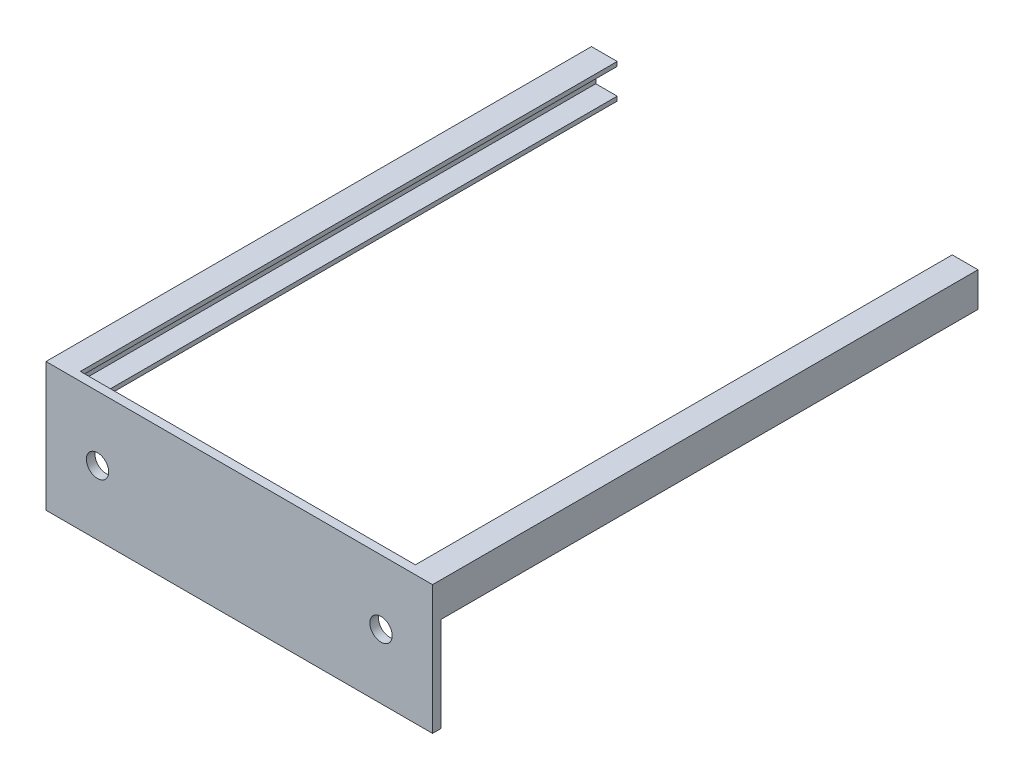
ISO-10303-21;
HEADER;
FILE_DESCRIPTION(('STEP AP214'),'2;1');
FILE_NAME('part.step','',(''),(''),'','','');
FILE_SCHEMA(('AUTOMOTIVE_DESIGN { 1 0 10303 214 1 1 1 1 }'));
ENDSEC;
DATA;
#1=APPLICATION_CONTEXT('core data for automotive mechanical design processes');
#2=APPLICATION_PROTOCOL_DEFINITION('international standard','automotive_design',2000,#1);
#3=PRODUCT_CONTEXT('',#1,'mechanical');
#4=PRODUCT('Part','Part','',(#3));
#5=PRODUCT_RELATED_PRODUCT_CATEGORY('part','',(#4));
#6=PRODUCT_DEFINITION_FORMATION('','',#4);
#7=PRODUCT_DEFINITION_CONTEXT('part definition',#1,'design');
#8=PRODUCT_DEFINITION('design','',#6,#7);
#9=PRODUCT_DEFINITION_SHAPE('','',#8);
#10=(LENGTH_UNIT() NAMED_UNIT(*) SI_UNIT(.MILLI.,.METRE.));
#11=(NAMED_UNIT(*) PLANE_ANGLE_UNIT() SI_UNIT($,.RADIAN.));
#12=(NAMED_UNIT(*) SI_UNIT($,.STERADIAN.) SOLID_ANGLE_UNIT());
#13=UNCERTAINTY_MEASURE_WITH_UNIT(LENGTH_MEASURE(1.E-05),#10,'distance_accuracy_value','');
#14=(GEOMETRIC_REPRESENTATION_CONTEXT(3) GLOBAL_UNCERTAINTY_ASSIGNED_CONTEXT((#13)) GLOBAL_UNIT_ASSIGNED_CONTEXT((#10,
#11,#12)) REPRESENTATION_CONTEXT('',''));
#15=CARTESIAN_POINT('',(0.,0.,0.));
#16=DIRECTION('',(0.,0.,1.));
#17=DIRECTION('',(1.,0.,0.));
#18=AXIS2_PLACEMENT_3D('',#15,#16,#17);
#19=CARTESIAN_POINT('',(0.,0.,125.));
#20=DIRECTION('',(-1.,0.,0.));
#21=DIRECTION('',(0.,0.,1.));
#22=AXIS2_PLACEMENT_3D('',#19,#20,#21);
#23=PLANE('',#22);
#24=DIRECTION('',(0.,1.,0.));
#25=VECTOR('',#24,1.);
#26=CARTESIAN_POINT('',(0.,0.,0.));
#27=LINE('',#26,#25);
#28=CARTESIAN_POINT('',(0.,0.,0.));
#29=VERTEX_POINT('',#28);
#30=CARTESIAN_POINT('',(0.,1.,0.));
#31=VERTEX_POINT('',#30);
#32=EDGE_CURVE('E212',#29,#31,#27,.T.);
#33=ORIENTED_EDGE('',*,*,#32,.T.);
#34=DIRECTION('',(0.,0.,-1.));
#35=VECTOR('',#34,1.);
#36=CARTESIAN_POINT('',(0.,1.,125.));
#37=LINE('',#36,#35);
#38=CARTESIAN_POINT('',(0.,1.,125.));
#39=VERTEX_POINT('',#38);
#40=EDGE_CURVE('E11',#39,#31,#37,.T.);
#41=ORIENTED_EDGE('',*,*,#40,.F.);
#42=DIRECTION('',(0.,1.,0.));
#43=VECTOR('',#42,1.);
#44=CARTESIAN_POINT('',(0.,0.,125.));
#45=LINE('',#44,#43);
#46=CARTESIAN_POINT('',(0.,0.,125.));
#47=VERTEX_POINT('',#46);
#48=EDGE_CURVE('E213',#47,#39,#45,.T.);
#49=ORIENTED_EDGE('',*,*,#48,.F.);
#50=DIRECTION('',(0.,0.,-1.));
#51=VECTOR('',#50,1.);
#52=CARTESIAN_POINT('',(0.,0.,125.));
#53=LINE('',#52,#51);
#54=EDGE_CURVE('E232',#47,#29,#53,.T.);
#55=ORIENTED_EDGE('',*,*,#54,.T.);
#56=EDGE_LOOP('',(#33,#41,#49,#55));
#57=FACE_BOUND('',#56,.T.);
#58=ADVANCED_FACE('F32',(#57),#23,.F.);
#59=CARTESIAN_POINT('',(0.,1.,125.));
#60=DIRECTION('',(0.,-1.,0.));
#61=DIRECTION('',(1.,0.,0.));
#62=AXIS2_PLACEMENT_3D('',#59,#60,#61);
#63=PLANE('',#62);
#64=DIRECTION('',(-1.,0.,0.));
#65=VECTOR('',#64,1.);
#66=CARTESIAN_POINT('',(0.,1.,0.));
#67=LINE('',#66,#65);
#68=CARTESIAN_POINT('',(-5.,0.999999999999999,0.));
#69=VERTEX_POINT('',#68);
#70=EDGE_CURVE('E235',#31,#69,#67,.T.);
#71=ORIENTED_EDGE('',*,*,#70,.T.);
#72=DIRECTION('',(0.,0.,-1.));
#73=VECTOR('',#72,1.);
#74=CARTESIAN_POINT('',(-5.,0.999999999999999,125.));
#75=LINE('',#74,#73);
#76=CARTESIAN_POINT('',(-5.,0.999999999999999,125.));
#77=VERTEX_POINT('',#76);
#78=EDGE_CURVE('E39',#77,#69,#75,.T.);
#79=ORIENTED_EDGE('',*,*,#78,.F.);
#80=DIRECTION('',(-1.,0.,0.));
#81=VECTOR('',#80,1.);
#82=CARTESIAN_POINT('',(0.,1.,125.));
#83=LINE('',#82,#81);
#84=EDGE_CURVE('E216',#39,#77,#83,.T.);
#85=ORIENTED_EDGE('',*,*,#84,.F.);
#86=ORIENTED_EDGE('',*,*,#40,.T.);
#87=EDGE_LOOP('',(#71,#79,#85,#86));
#88=FACE_BOUND('',#87,.T.);
#89=ADVANCED_FACE('F284',(#88),#63,.F.);
#90=CARTESIAN_POINT('',(-5.,0.999999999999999,125.));
#91=DIRECTION('',(-1.,0.,0.));
#92=DIRECTION('',(0.,-1.,0.));
#93=AXIS2_PLACEMENT_3D('',#90,#91,#92);
#94=PLANE('',#93);
#95=DIRECTION('',(0.,1.,0.));
#96=VECTOR('',#95,1.);
#97=CARTESIAN_POINT('',(-5.,0.999999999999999,0.));
#98=LINE('',#97,#96);
#99=CARTESIAN_POINT('',(-5.,7.,0.));
#100=VERTEX_POINT('',#99);
#101=EDGE_CURVE('E237',#69,#100,#98,.T.);
#102=ORIENTED_EDGE('',*,*,#101,.T.);
#103=DIRECTION('',(0.,0.,-1.));
#104=VECTOR('',#103,1.);
#105=CARTESIAN_POINT('',(-5.,7.,125.));
#106=LINE('',#105,#104);
#107=CARTESIAN_POINT('',(-5.,7.,125.));
#108=VERTEX_POINT('',#107);
#109=EDGE_CURVE('E262',#108,#100,#106,.T.);
#110=ORIENTED_EDGE('',*,*,#109,.F.);
#111=DIRECTION('',(0.,1.,0.));
#112=VECTOR('',#111,1.);
#113=CARTESIAN_POINT('',(-5.,0.999999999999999,125.));
#114=LINE('',#113,#112);
#115=EDGE_CURVE('E220',#77,#108,#114,.T.);
#116=ORIENTED_EDGE('',*,*,#115,.F.);
#117=ORIENTED_EDGE('',*,*,#78,.T.);
#118=EDGE_LOOP('',(#102,#110,#116,#117));
#119=FACE_BOUND('',#118,.T.);
#120=ADVANCED_FACE('F268',(#119),#94,.F.);
#121=CARTESIAN_POINT('',(-5.,7.,125.));
#122=DIRECTION('',(0.,1.,0.));
#123=DIRECTION('',(0.,0.,1.));
#124=AXIS2_PLACEMENT_3D('',#121,#122,#123);
#125=PLANE('',#124);
#126=DIRECTION('',(1.,0.,0.));
#127=VECTOR('',#126,1.);
#128=CARTESIAN_POINT('',(-5.,7.,0.));
#129=LINE('',#128,#127);
#130=CARTESIAN_POINT('',(0.,7.,0.));
#131=VERTEX_POINT('',#130);
#132=EDGE_CURVE('E239',#100,#131,#129,.T.);
#133=ORIENTED_EDGE('',*,*,#132,.T.);
#134=DIRECTION('',(0.,0.,-1.));
#135=VECTOR('',#134,1.);
#136=CARTESIAN_POINT('',(0.,7.,125.));
#137=LINE('',#136,#135);
#138=CARTESIAN_POINT('',(0.,7.,125.));
#139=VERTEX_POINT('',#138);
#140=EDGE_CURVE('E259',#139,#131,#137,.T.);
#141=ORIENTED_EDGE('',*,*,#140,.F.);
#142=DIRECTION('',(1.,0.,0.));
#143=VECTOR('',#142,1.);
#144=CARTESIAN_POINT('',(-5.,7.,125.));
#145=LINE('',#144,#143);
#146=EDGE_CURVE('E223',#108,#139,#145,.T.);
#147=ORIENTED_EDGE('',*,*,#146,.F.);
#148=ORIENTED_EDGE('',*,*,#109,.T.);
#149=EDGE_LOOP('',(#133,#141,#147,#148));
#150=FACE_BOUND('',#149,.T.);
#151=ADVANCED_FACE('F277',(#150),#125,.F.);
#152=CARTESIAN_POINT('',(0.,7.,125.));
#153=DIRECTION('',(-1.,0.,0.));
#154=DIRECTION('',(0.,-1.,0.));
#155=AXIS2_PLACEMENT_3D('',#152,#153,#154);
#156=PLANE('',#155);
#157=DIRECTION('',(0.,1.,0.));
#158=VECTOR('',#157,1.);
#159=CARTESIAN_POINT('',(0.,7.,0.));
#160=LINE('',#159,#158);
#161=CARTESIAN_POINT('',(0.,8.,0.));
#162=VERTEX_POINT('',#161);
#163=EDGE_CURVE('E241',#131,#162,#160,.T.);
#164=ORIENTED_EDGE('',*,*,#163,.T.);
#165=DIRECTION('',(0.,0.,-1.));
#166=VECTOR('',#165,1.);
#167=CARTESIAN_POINT('',(0.,8.,125.));
#168=LINE('',#167,#166);
#169=CARTESIAN_POINT('',(0.,8.,125.));
#170=VERTEX_POINT('',#169);
#171=EDGE_CURVE('E256',#170,#162,#168,.T.);
#172=ORIENTED_EDGE('',*,*,#171,.F.);
#173=DIRECTION('',(0.,1.,0.));
#174=VECTOR('',#173,1.);
#175=CARTESIAN_POINT('',(0.,7.,125.));
#176=LINE('',#175,#174);
#177=EDGE_CURVE('E226',#139,#170,#176,.T.);
#178=ORIENTED_EDGE('',*,*,#177,.F.);
#179=ORIENTED_EDGE('',*,*,#140,.T.);
#180=EDGE_LOOP('',(#164,#172,#178,#179));
#181=FACE_BOUND('',#180,.T.);
#182=ADVANCED_FACE('F281',(#181),#156,.F.);
#183=CARTESIAN_POINT('',(0.,8.,125.));
#184=DIRECTION('',(0.,-1.,0.));
#185=DIRECTION('',(0.,0.,-1.));
#186=AXIS2_PLACEMENT_3D('',#183,#184,#185);
#187=PLANE('',#186);
#188=DIRECTION('',(-1.,0.,0.));
#189=VECTOR('',#188,1.);
#190=CARTESIAN_POINT('',(0.,8.,0.));
#191=LINE('',#190,#189);
#192=CARTESIAN_POINT('',(-6.,8.,0.));
#193=VERTEX_POINT('',#192);
#194=EDGE_CURVE('E243',#162,#193,#191,.T.);
#195=ORIENTED_EDGE('',*,*,#194,.T.);
#196=DIRECTION('',(0.,0.,-1.));
#197=VECTOR('',#196,1.);
#198=CARTESIAN_POINT('',(-6.,8.,125.));
#199=LINE('',#198,#197);
#200=CARTESIAN_POINT('',(-6.,8.,127.));
#201=VERTEX_POINT('',#200);
#202=EDGE_CURVE('E253',#201,#193,#199,.T.);
#203=ORIENTED_EDGE('',*,*,#202,.F.);
#204=DIRECTION('',(1.,0.,0.));
#205=VECTOR('',#204,1.);
#206=CARTESIAN_POINT('',(-6.,8.,127.));
#207=LINE('',#206,#205);
#208=CARTESIAN_POINT('',(84.,8.,127.));
#209=VERTEX_POINT('',#208);
#210=EDGE_CURVE('E200',#201,#209,#207,.T.);
#211=ORIENTED_EDGE('',*,*,#210,.T.);
#212=DIRECTION('',(0.,0.,-1.));
#213=VECTOR('',#212,1.);
#214=CARTESIAN_POINT('',(84.,8.,127.));
#215=LINE('',#214,#213);
#216=CARTESIAN_POINT('',(84.,8.,0.));
#217=VERTEX_POINT('',#216);
#218=EDGE_CURVE('E203',#209,#217,#215,.T.);
#219=ORIENTED_EDGE('',*,*,#218,.T.);
#220=DIRECTION('',(1.,0.,0.));
#221=VECTOR('',#220,1.);
#222=CARTESIAN_POINT('',(78.,8.,0.));
#223=LINE('',#222,#221);
#224=CARTESIAN_POINT('',(78.,8.,0.));
#225=VERTEX_POINT('',#224);
#226=EDGE_CURVE('E303',#225,#217,#223,.T.);
#227=ORIENTED_EDGE('',*,*,#226,.F.);
#228=DIRECTION('',(0.,0.,-1.));
#229=VECTOR('',#228,1.);
#230=CARTESIAN_POINT('',(78.,8.,125.));
#231=LINE('',#230,#229);
#232=CARTESIAN_POINT('',(78.,8.,125.));
#233=VERTEX_POINT('',#232);
#234=EDGE_CURVE('E179',#233,#225,#231,.T.);
#235=ORIENTED_EDGE('',*,*,#234,.F.);
#236=DIRECTION('',(1.,0.,0.));
#237=VECTOR('',#236,1.);
#238=CARTESIAN_POINT('',(-6.,8.,125.));
#239=LINE('',#238,#237);
#240=EDGE_CURVE('E166',#170,#233,#239,.T.);
#241=ORIENTED_EDGE('',*,*,#240,.F.);
#242=ORIENTED_EDGE('',*,*,#171,.T.);
#243=EDGE_LOOP('',(#195,#203,#211,#219,#227,#235,#241,#242));
#244=FACE_BOUND('',#243,.T.);
#245=ADVANCED_FACE('F299',(#244),#187,.F.);
#246=CARTESIAN_POINT('',(-6.,0.,125.));
#247=DIRECTION('',(1.,0.,0.));
#248=DIRECTION('',(0.,0.,-1.));
#249=AXIS2_PLACEMENT_3D('',#246,#247,#248);
#250=PLANE('',#249);
#251=DIRECTION('',(0.,-1.,0.));
#252=VECTOR('',#251,1.);
#253=CARTESIAN_POINT('',(-6.,0.,0.));
#254=LINE('',#253,#252);
#255=CARTESIAN_POINT('',(-6.,0.,0.));
#256=VERTEX_POINT('',#255);
#257=EDGE_CURVE('E245',#193,#256,#254,.T.);
#258=ORIENTED_EDGE('',*,*,#257,.T.);
#259=DIRECTION('',(0.,0.,-1.));
#260=VECTOR('',#259,1.);
#261=CARTESIAN_POINT('',(-6.,0.,125.));
#262=LINE('',#261,#260);
#263=CARTESIAN_POINT('',(-6.,0.,125.));
#264=VERTEX_POINT('',#263);
#265=EDGE_CURVE('E250',#264,#256,#262,.T.);
#266=ORIENTED_EDGE('',*,*,#265,.F.);
#267=DIRECTION('',(0.,-1.,0.));
#268=VECTOR('',#267,1.);
#269=CARTESIAN_POINT('',(-6.,8.,125.));
#270=LINE('',#269,#268);
#271=CARTESIAN_POINT('',(-6.,-22.,125.));
#272=VERTEX_POINT('',#271);
#273=EDGE_CURVE('E192',#264,#272,#270,.T.);
#274=ORIENTED_EDGE('',*,*,#273,.T.);
#275=DIRECTION('',(0.,0.,-1.));
#276=VECTOR('',#275,1.);
#277=CARTESIAN_POINT('',(-6.,-22.,127.));
#278=LINE('',#277,#276);
#279=CARTESIAN_POINT('',(-6.,-22.,127.));
#280=VERTEX_POINT('',#279);
#281=EDGE_CURVE('E209',#280,#272,#278,.T.);
#282=ORIENTED_EDGE('',*,*,#281,.F.);
#283=DIRECTION('',(0.,-1.,0.));
#284=VECTOR('',#283,1.);
#285=CARTESIAN_POINT('',(-6.,8.,127.));
#286=LINE('',#285,#284);
#287=EDGE_CURVE('E193',#201,#280,#286,.T.);
#288=ORIENTED_EDGE('',*,*,#287,.F.);
#289=ORIENTED_EDGE('',*,*,#202,.T.);
#290=EDGE_LOOP('',(#258,#266,#274,#282,#288,#289));
#291=FACE_BOUND('',#290,.T.);
#292=ADVANCED_FACE('F294',(#291),#250,.F.);
#293=CARTESIAN_POINT('',(0.,0.,125.));
#294=DIRECTION('',(0.,1.,0.));
#295=DIRECTION('',(-1.,0.,0.));
#296=AXIS2_PLACEMENT_3D('',#293,#294,#295);
#297=PLANE('',#296);
#298=DIRECTION('',(1.,0.,0.));
#299=VECTOR('',#298,1.);
#300=CARTESIAN_POINT('',(0.,0.,0.));
#301=LINE('',#300,#299);
#302=EDGE_CURVE('E217',#256,#29,#301,.T.);
#303=ORIENTED_EDGE('',*,*,#302,.T.);
#304=ORIENTED_EDGE('',*,*,#54,.F.);
#305=DIRECTION('',(1.,0.,0.));
#306=VECTOR('',#305,1.);
#307=CARTESIAN_POINT('',(0.,0.,125.));
#308=LINE('',#307,#306);
#309=EDGE_CURVE('E229',#264,#47,#308,.T.);
#310=ORIENTED_EDGE('',*,*,#309,.F.);
#311=ORIENTED_EDGE('',*,*,#265,.T.);
#312=EDGE_LOOP('',(#303,#304,#310,#311));
#313=FACE_BOUND('',#312,.T.);
#314=ADVANCED_FACE('F290',(#313),#297,.F.);
#315=CARTESIAN_POINT('',(0.,0.,0.));
#316=DIRECTION('',(0.,0.,1.));
#317=DIRECTION('',(1.,0.,0.));
#318=AXIS2_PLACEMENT_3D('',#315,#316,#317);
#319=PLANE('',#318);
#320=ORIENTED_EDGE('',*,*,#32,.F.);
#321=ORIENTED_EDGE('',*,*,#302,.F.);
#322=ORIENTED_EDGE('',*,*,#257,.F.);
#323=ORIENTED_EDGE('',*,*,#194,.F.);
#324=ORIENTED_EDGE('',*,*,#163,.F.);
#325=ORIENTED_EDGE('',*,*,#132,.F.);
#326=ORIENTED_EDGE('',*,*,#101,.F.);
#327=ORIENTED_EDGE('',*,*,#70,.F.);
#328=EDGE_LOOP('',(#320,#321,#322,#323,#324,#325,#326,#327));
#329=FACE_BOUND('',#328,.T.);
#330=ADVANCED_FACE('F273',(#329),#319,.F.);
#331=CARTESIAN_POINT('',(0.,0.,125.));
#332=DIRECTION('',(0.,0.,1.));
#333=DIRECTION('',(1.,0.,0.));
#334=AXIS2_PLACEMENT_3D('',#331,#332,#333);
#335=PLANE('',#334);
#336=CARTESIAN_POINT('',(72.,-7.,125.));
#337=DIRECTION('',(0.,0.,1.));
#338=DIRECTION('',(1.,0.,0.));
#339=AXIS2_PLACEMENT_3D('',#336,#337,#338);
#340=CIRCLE('',#339,2.6);
#341=CARTESIAN_POINT('',(74.6,-7.,125.));
#342=VERTEX_POINT('',#341);
#343=EDGE_CURVE('E324',#342,#342,#340,.T.);
#344=ORIENTED_EDGE('',*,*,#343,.T.);
#345=EDGE_LOOP('',(#344));
#346=FACE_BOUND('',#345,.T.);
#347=CARTESIAN_POINT('',(6.,-7.,125.));
#348=DIRECTION('',(0.,0.,1.));
#349=DIRECTION('',(1.,0.,0.));
#350=AXIS2_PLACEMENT_3D('',#347,#348,#349);
#351=CIRCLE('',#350,2.6);
#352=CARTESIAN_POINT('',(8.6,-7.,125.));
#353=VERTEX_POINT('',#352);
#354=EDGE_CURVE('E189',#353,#353,#351,.T.);
#355=ORIENTED_EDGE('',*,*,#354,.T.);
#356=EDGE_LOOP('',(#355));
#357=FACE_BOUND('',#356,.T.);
#358=DIRECTION('',(0.,1.,0.));
#359=VECTOR('',#358,1.);
#360=CARTESIAN_POINT('',(78.,0.,125.));
#361=LINE('',#360,#359);
#362=CARTESIAN_POINT('',(78.,0.,125.));
#363=VERTEX_POINT('',#362);
#364=CARTESIAN_POINT('',(78.,1.,125.));
#365=VERTEX_POINT('',#364);
#366=EDGE_CURVE('E46',#363,#365,#361,.T.);
#367=ORIENTED_EDGE('',*,*,#366,.F.);
#368=DIRECTION('',(-1.,0.,0.));
#369=VECTOR('',#368,1.);
#370=CARTESIAN_POINT('',(78.,0.,125.));
#371=LINE('',#370,#369);
#372=CARTESIAN_POINT('',(84.,0.,125.));
#373=VERTEX_POINT('',#372);
#374=EDGE_CURVE('E170',#373,#363,#371,.T.);
#375=ORIENTED_EDGE('',*,*,#374,.F.);
#376=DIRECTION('',(0.,-1.,0.));
#377=VECTOR('',#376,1.);
#378=CARTESIAN_POINT('',(84.,8.,125.));
#379=LINE('',#378,#377);
#380=CARTESIAN_POINT('',(84.,-22.,125.));
#381=VERTEX_POINT('',#380);
#382=EDGE_CURVE('E155',#373,#381,#379,.T.);
#383=ORIENTED_EDGE('',*,*,#382,.T.);
#384=DIRECTION('',(1.,0.,0.));
#385=VECTOR('',#384,1.);
#386=CARTESIAN_POINT('',(-6.,-22.,125.));
#387=LINE('',#386,#385);
#388=EDGE_CURVE('E167',#272,#381,#387,.T.);
#389=ORIENTED_EDGE('',*,*,#388,.F.);
#390=ORIENTED_EDGE('',*,*,#273,.F.);
#391=ORIENTED_EDGE('',*,*,#309,.T.);
#392=ORIENTED_EDGE('',*,*,#48,.T.);
#393=ORIENTED_EDGE('',*,*,#84,.T.);
#394=ORIENTED_EDGE('',*,*,#115,.T.);
#395=ORIENTED_EDGE('',*,*,#146,.T.);
#396=ORIENTED_EDGE('',*,*,#177,.T.);
#397=ORIENTED_EDGE('',*,*,#240,.T.);
#398=DIRECTION('',(0.,1.,0.));
#399=VECTOR('',#398,1.);
#400=CARTESIAN_POINT('',(78.,7.,125.));
#401=LINE('',#400,#399);
#402=CARTESIAN_POINT('',(78.,7.,125.));
#403=VERTEX_POINT('',#402);
#404=EDGE_CURVE('E53',#403,#233,#401,.T.);
#405=ORIENTED_EDGE('',*,*,#404,.F.);
#406=DIRECTION('',(-1.,0.,0.));
#407=VECTOR('',#406,1.);
#408=CARTESIAN_POINT('',(83.,7.,125.));
#409=LINE('',#408,#407);
#410=CARTESIAN_POINT('',(83.,7.,125.));
#411=VERTEX_POINT('',#410);
#412=EDGE_CURVE('E309',#411,#403,#409,.T.);
#413=ORIENTED_EDGE('',*,*,#412,.F.);
#414=DIRECTION('',(0.,1.,0.));
#415=VECTOR('',#414,1.);
#416=CARTESIAN_POINT('',(83.,0.999999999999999,125.));
#417=LINE('',#416,#415);
#418=CARTESIAN_POINT('',(83.,0.999999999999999,125.));
#419=VERTEX_POINT('',#418);
#420=EDGE_CURVE('E311',#419,#411,#417,.T.);
#421=ORIENTED_EDGE('',*,*,#420,.F.);
#422=DIRECTION('',(1.,0.,0.));
#423=VECTOR('',#422,1.);
#424=CARTESIAN_POINT('',(78.,1.,125.));
#425=LINE('',#424,#423);
#426=EDGE_CURVE('E317',#365,#419,#425,.T.);
#427=ORIENTED_EDGE('',*,*,#426,.F.);
#428=EDGE_LOOP('',(#367,#375,#383,#389,#390,#391,#392,#393,#394,#395,#396,#397,#405,#413,#421,#427));
#429=FACE_BOUND('',#428,.T.);
#430=ADVANCED_FACE('F171',(#346,#357,#429),#335,.F.);
#431=CARTESIAN_POINT('',(-6.,-22.,127.));
#432=DIRECTION('',(0.,1.,0.));
#433=DIRECTION('',(0.,0.,1.));
#434=AXIS2_PLACEMENT_3D('',#431,#432,#433);
#435=PLANE('',#434);
#436=ORIENTED_EDGE('',*,*,#388,.T.);
#437=DIRECTION('',(0.,0.,-1.));
#438=VECTOR('',#437,1.);
#439=CARTESIAN_POINT('',(84.,-22.,127.));
#440=LINE('',#439,#438);
#441=CARTESIAN_POINT('',(84.,-22.,127.));
#442=VERTEX_POINT('',#441);
#443=EDGE_CURVE('E163',#442,#381,#440,.T.);
#444=ORIENTED_EDGE('',*,*,#443,.F.);
#445=DIRECTION('',(1.,0.,0.));
#446=VECTOR('',#445,1.);
#447=CARTESIAN_POINT('',(-6.,-22.,127.));
#448=LINE('',#447,#446);
#449=EDGE_CURVE('E196',#280,#442,#448,.T.);
#450=ORIENTED_EDGE('',*,*,#449,.F.);
#451=ORIENTED_EDGE('',*,*,#281,.T.);
#452=EDGE_LOOP('',(#436,#444,#450,#451));
#453=FACE_BOUND('',#452,.T.);
#454=ADVANCED_FACE('F379',(#453),#435,.F.);
#455=CARTESIAN_POINT('',(84.,8.,127.));
#456=DIRECTION('',(1.,0.,0.));
#457=DIRECTION('',(0.,0.,-1.));
#458=AXIS2_PLACEMENT_3D('',#455,#456,#457);
#459=PLANE('',#458);
#460=ORIENTED_EDGE('',*,*,#382,.F.);
#461=DIRECTION('',(0.,0.,-1.));
#462=VECTOR('',#461,1.);
#463=CARTESIAN_POINT('',(84.,0.,125.));
#464=LINE('',#463,#462);
#465=CARTESIAN_POINT('',(84.,0.,0.));
#466=VERTEX_POINT('',#465);
#467=EDGE_CURVE('E159',#373,#466,#464,.T.);
#468=ORIENTED_EDGE('',*,*,#467,.T.);
#469=DIRECTION('',(0.,-1.,0.));
#470=VECTOR('',#469,1.);
#471=CARTESIAN_POINT('',(84.,0.,0.));
#472=LINE('',#471,#470);
#473=EDGE_CURVE('E326',#217,#466,#472,.T.);
#474=ORIENTED_EDGE('',*,*,#473,.F.);
#475=ORIENTED_EDGE('',*,*,#218,.F.);
#476=DIRECTION('',(0.,-1.,0.));
#477=VECTOR('',#476,1.);
#478=CARTESIAN_POINT('',(84.,8.,127.));
#479=LINE('',#478,#477);
#480=EDGE_CURVE('E198',#209,#442,#479,.T.);
#481=ORIENTED_EDGE('',*,*,#480,.T.);
#482=ORIENTED_EDGE('',*,*,#443,.T.);
#483=EDGE_LOOP('',(#460,#468,#474,#475,#481,#482));
#484=FACE_BOUND('',#483,.T.);
#485=ADVANCED_FACE('F156',(#484),#459,.T.);
#486=CARTESIAN_POINT('',(0.,0.,127.));
#487=DIRECTION('',(0.,0.,1.));
#488=DIRECTION('',(1.,0.,0.));
#489=AXIS2_PLACEMENT_3D('',#486,#487,#488);
#490=PLANE('',#489);
#491=CARTESIAN_POINT('',(72.,-7.,127.));
#492=DIRECTION('',(0.,0.,1.));
#493=DIRECTION('',(1.,0.,0.));
#494=AXIS2_PLACEMENT_3D('',#491,#492,#493);
#495=CIRCLE('',#494,2.6);
#496=CARTESIAN_POINT('',(74.6,-7.,127.));
#497=VERTEX_POINT('',#496);
#498=EDGE_CURVE('E364',#497,#497,#495,.T.);
#499=ORIENTED_EDGE('',*,*,#498,.F.);
#500=EDGE_LOOP('',(#499));
#501=FACE_BOUND('',#500,.T.);
#502=CARTESIAN_POINT('',(6.,-7.,127.));
#503=DIRECTION('',(0.,0.,1.));
#504=DIRECTION('',(1.,0.,0.));
#505=AXIS2_PLACEMENT_3D('',#502,#503,#504);
#506=CIRCLE('',#505,2.6);
#507=CARTESIAN_POINT('',(8.6,-7.,127.));
#508=VERTEX_POINT('',#507);
#509=EDGE_CURVE('E181',#508,#508,#506,.T.);
#510=ORIENTED_EDGE('',*,*,#509,.F.);
#511=EDGE_LOOP('',(#510));
#512=FACE_BOUND('',#511,.T.);
#513=ORIENTED_EDGE('',*,*,#287,.T.);
#514=ORIENTED_EDGE('',*,*,#449,.T.);
#515=ORIENTED_EDGE('',*,*,#480,.F.);
#516=ORIENTED_EDGE('',*,*,#210,.F.);
#517=EDGE_LOOP('',(#513,#514,#515,#516));
#518=FACE_BOUND('',#517,.T.);
#519=ADVANCED_FACE('F370',(#501,#512,#518),#490,.T.);
#520=CARTESIAN_POINT('',(6.,-7.,127.));
#521=DIRECTION('',(0.,0.,1.));
#522=DIRECTION('',(1.,0.,0.));
#523=AXIS2_PLACEMENT_3D('',#520,#521,#522);
#524=CYLINDRICAL_SURFACE('',#523,2.6);
#525=ORIENTED_EDGE('',*,*,#354,.F.);
#526=EDGE_LOOP('',(#525));
#527=FACE_BOUND('',#526,.T.);
#528=ORIENTED_EDGE('',*,*,#509,.T.);
#529=EDGE_LOOP('',(#528));
#530=FACE_BOUND('',#529,.T.);
#531=ADVANCED_FACE('F373',(#527,#530),#524,.F.);
#532=CARTESIAN_POINT('',(78.,0.,125.));
#533=DIRECTION('',(-1.,0.,0.));
#534=DIRECTION('',(0.,0.,1.));
#535=AXIS2_PLACEMENT_3D('',#532,#533,#534);
#536=PLANE('',#535);
#537=DIRECTION('',(0.,1.,0.));
#538=VECTOR('',#537,1.);
#539=CARTESIAN_POINT('',(78.,0.,0.));
#540=LINE('',#539,#538);
#541=CARTESIAN_POINT('',(78.,0.,0.));
#542=VERTEX_POINT('',#541);
#543=CARTESIAN_POINT('',(78.,1.,0.));
#544=VERTEX_POINT('',#543);
#545=EDGE_CURVE('E321',#542,#544,#540,.T.);
#546=ORIENTED_EDGE('',*,*,#545,.F.);
#547=DIRECTION('',(0.,0.,-1.));
#548=VECTOR('',#547,1.);
#549=CARTESIAN_POINT('',(78.,0.,125.));
#550=LINE('',#549,#548);
#551=EDGE_CURVE('E178',#363,#542,#550,.T.);
#552=ORIENTED_EDGE('',*,*,#551,.F.);
#553=ORIENTED_EDGE('',*,*,#366,.T.);
#554=DIRECTION('',(0.,0.,-1.));
#555=VECTOR('',#554,1.);
#556=CARTESIAN_POINT('',(78.,1.,125.));
#557=LINE('',#556,#555);
#558=EDGE_CURVE('E320',#365,#544,#557,.T.);
#559=ORIENTED_EDGE('',*,*,#558,.T.);
#560=EDGE_LOOP('',(#546,#552,#553,#559));
#561=FACE_BOUND('',#560,.T.);
#562=ADVANCED_FACE('F360',(#561),#536,.T.);
#563=CARTESIAN_POINT('',(78.,0.,125.));
#564=DIRECTION('',(0.,-1.,0.));
#565=DIRECTION('',(1.,0.,0.));
#566=AXIS2_PLACEMENT_3D('',#563,#564,#565);
#567=PLANE('',#566);
#568=DIRECTION('',(-1.,0.,0.));
#569=VECTOR('',#568,1.);
#570=CARTESIAN_POINT('',(78.,0.,0.));
#571=LINE('',#570,#569);
#572=EDGE_CURVE('E176',#466,#542,#571,.T.);
#573=ORIENTED_EDGE('',*,*,#572,.F.);
#574=ORIENTED_EDGE('',*,*,#467,.F.);
#575=ORIENTED_EDGE('',*,*,#374,.T.);
#576=ORIENTED_EDGE('',*,*,#551,.T.);
#577=EDGE_LOOP('',(#573,#574,#575,#576));
#578=FACE_BOUND('',#577,.T.);
#579=ADVANCED_FACE('F174',(#578),#567,.T.);
#580=CARTESIAN_POINT('',(78.,7.,125.));
#581=DIRECTION('',(-1.,0.,0.));
#582=DIRECTION('',(0.,-1.,0.));
#583=AXIS2_PLACEMENT_3D('',#580,#581,#582);
#584=PLANE('',#583);
#585=DIRECTION('',(0.,1.,0.));
#586=VECTOR('',#585,1.);
#587=CARTESIAN_POINT('',(78.,7.,0.));
#588=LINE('',#587,#586);
#589=CARTESIAN_POINT('',(78.,7.,0.));
#590=VERTEX_POINT('',#589);
#591=EDGE_CURVE('E329',#590,#225,#588,.T.);
#592=ORIENTED_EDGE('',*,*,#591,.F.);
#593=DIRECTION('',(0.,0.,-1.));
#594=VECTOR('',#593,1.);
#595=CARTESIAN_POINT('',(78.,7.,125.));
#596=LINE('',#595,#594);
#597=EDGE_CURVE('E183',#403,#590,#596,.T.);
#598=ORIENTED_EDGE('',*,*,#597,.F.);
#599=ORIENTED_EDGE('',*,*,#404,.T.);
#600=ORIENTED_EDGE('',*,*,#234,.T.);
#601=EDGE_LOOP('',(#592,#598,#599,#600));
#602=FACE_BOUND('',#601,.T.);
#603=ADVANCED_FACE('F307',(#602),#584,.T.);
#604=CARTESIAN_POINT('',(83.,7.,125.));
#605=DIRECTION('',(0.,-1.,0.));
#606=DIRECTION('',(0.,0.,-1.));
#607=AXIS2_PLACEMENT_3D('',#604,#605,#606);
#608=PLANE('',#607);
#609=DIRECTION('',(-1.,0.,0.));
#610=VECTOR('',#609,1.);
#611=CARTESIAN_POINT('',(83.,7.,0.));
#612=LINE('',#611,#610);
#613=CARTESIAN_POINT('',(83.,7.,0.));
#614=VERTEX_POINT('',#613);
#615=EDGE_CURVE('E331',#614,#590,#612,.T.);
#616=ORIENTED_EDGE('',*,*,#615,.F.);
#617=DIRECTION('',(0.,0.,-1.));
#618=VECTOR('',#617,1.);
#619=CARTESIAN_POINT('',(83.,7.,125.));
#620=LINE('',#619,#618);
#621=EDGE_CURVE('E343',#411,#614,#620,.T.);
#622=ORIENTED_EDGE('',*,*,#621,.F.);
#623=ORIENTED_EDGE('',*,*,#412,.T.);
#624=ORIENTED_EDGE('',*,*,#597,.T.);
#625=EDGE_LOOP('',(#616,#622,#623,#624));
#626=FACE_BOUND('',#625,.T.);
#627=ADVANCED_FACE('F346',(#626),#608,.T.);
#628=CARTESIAN_POINT('',(83.,0.999999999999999,125.));
#629=DIRECTION('',(-1.,0.,0.));
#630=DIRECTION('',(0.,-1.,0.));
#631=AXIS2_PLACEMENT_3D('',#628,#629,#630);
#632=PLANE('',#631);
#633=DIRECTION('',(0.,1.,0.));
#634=VECTOR('',#633,1.);
#635=CARTESIAN_POINT('',(83.,0.999999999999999,0.));
#636=LINE('',#635,#634);
#637=CARTESIAN_POINT('',(83.,0.999999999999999,0.));
#638=VERTEX_POINT('',#637);
#639=EDGE_CURVE('E334',#638,#614,#636,.T.);
#640=ORIENTED_EDGE('',*,*,#639,.F.);
#641=DIRECTION('',(0.,0.,-1.));
#642=VECTOR('',#641,1.);
#643=CARTESIAN_POINT('',(83.,0.999999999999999,125.));
#644=LINE('',#643,#642);
#645=EDGE_CURVE('E341',#419,#638,#644,.T.);
#646=ORIENTED_EDGE('',*,*,#645,.F.);
#647=ORIENTED_EDGE('',*,*,#420,.T.);
#648=ORIENTED_EDGE('',*,*,#621,.T.);
#649=EDGE_LOOP('',(#640,#646,#647,#648));
#650=FACE_BOUND('',#649,.T.);
#651=ADVANCED_FACE('F354',(#650),#632,.T.);
#652=CARTESIAN_POINT('',(78.,1.,125.));
#653=DIRECTION('',(0.,1.,0.));
#654=DIRECTION('',(-1.,0.,0.));
#655=AXIS2_PLACEMENT_3D('',#652,#653,#654);
#656=PLANE('',#655);
#657=DIRECTION('',(1.,0.,0.));
#658=VECTOR('',#657,1.);
#659=CARTESIAN_POINT('',(78.,1.,0.));
#660=LINE('',#659,#658);
#661=EDGE_CURVE('E337',#544,#638,#660,.T.);
#662=ORIENTED_EDGE('',*,*,#661,.F.);
#663=ORIENTED_EDGE('',*,*,#558,.F.);
#664=ORIENTED_EDGE('',*,*,#426,.T.);
#665=ORIENTED_EDGE('',*,*,#645,.T.);
#666=EDGE_LOOP('',(#662,#663,#664,#665));
#667=FACE_BOUND('',#666,.T.);
#668=ADVANCED_FACE('F357',(#667),#656,.T.);
#669=CARTESIAN_POINT('',(78.,0.,0.));
#670=DIRECTION('',(0.,0.,1.));
#671=DIRECTION('',(-1.,0.,0.));
#672=AXIS2_PLACEMENT_3D('',#669,#670,#671);
#673=PLANE('',#672);
#674=ORIENTED_EDGE('',*,*,#545,.T.);
#675=ORIENTED_EDGE('',*,*,#661,.T.);
#676=ORIENTED_EDGE('',*,*,#639,.T.);
#677=ORIENTED_EDGE('',*,*,#615,.T.);
#678=ORIENTED_EDGE('',*,*,#591,.T.);
#679=ORIENTED_EDGE('',*,*,#226,.T.);
#680=ORIENTED_EDGE('',*,*,#473,.T.);
#681=ORIENTED_EDGE('',*,*,#572,.T.);
#682=EDGE_LOOP('',(#674,#675,#676,#677,#678,#679,#680,#681));
#683=FACE_BOUND('',#682,.T.);
#684=ADVANCED_FACE('F349',(#683),#673,.F.);
#685=CARTESIAN_POINT('',(72.,-7.,127.));
#686=DIRECTION('',(0.,0.,1.));
#687=DIRECTION('',(1.,0.,0.));
#688=AXIS2_PLACEMENT_3D('',#685,#686,#687);
#689=CYLINDRICAL_SURFACE('',#688,2.6);
#690=ORIENTED_EDGE('',*,*,#343,.F.);
#691=EDGE_LOOP('',(#690));
#692=FACE_BOUND('',#691,.T.);
#693=ORIENTED_EDGE('',*,*,#498,.T.);
#694=EDGE_LOOP('',(#693));
#695=FACE_BOUND('',#694,.T.);
#696=ADVANCED_FACE('F368',(#692,#695),#689,.F.);
#697=CLOSED_SHELL('',(#58,#89,#120,#151,#182,#245,#292,#314,#330,#430,#454,#485,#519,#531,#562,
#579,#603,#627,#651,#668,#684,#696));
#698=MANIFOLD_SOLID_BREP('B2',#697);
#699=ADVANCED_BREP_SHAPE_REPRESENTATION('',(#18,#698),#14);
#700=SHAPE_DEFINITION_REPRESENTATION(#9,#699);
ENDSEC;
END-ISO-10303-21;
